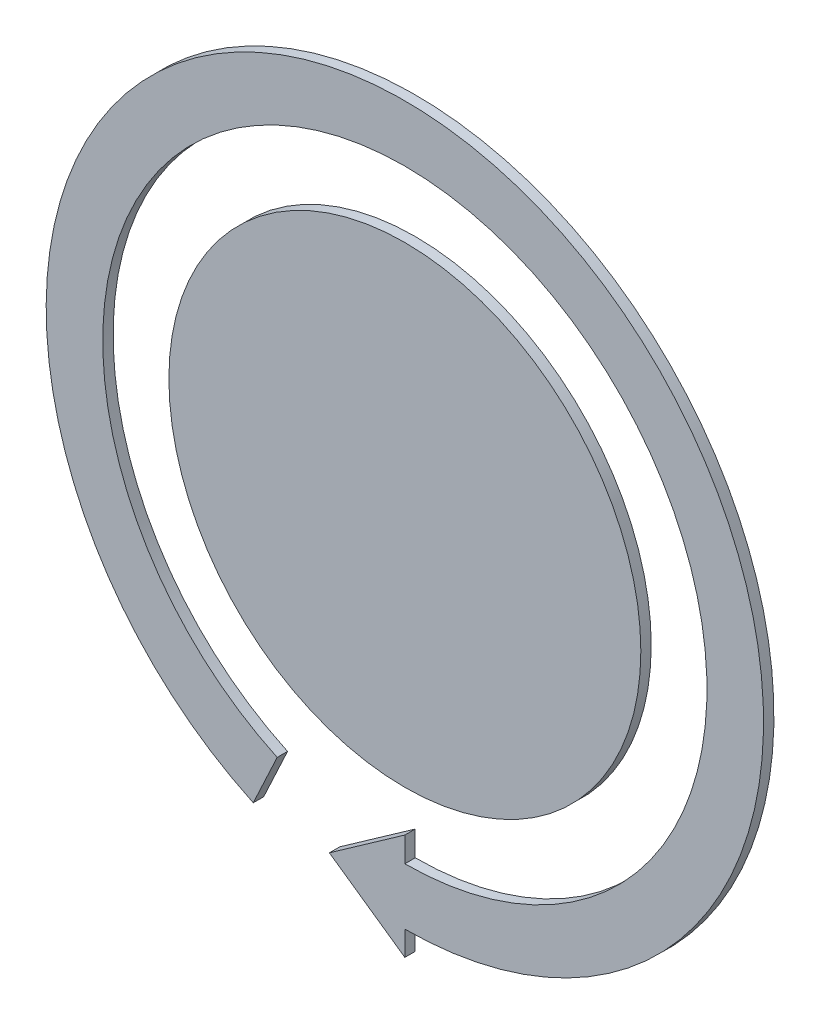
ISO-10303-21;
HEADER;
FILE_DESCRIPTION(('STEP AP214'),'2;1');
FILE_NAME('part.step','',(''),(''),'','','');
FILE_SCHEMA(('AUTOMOTIVE_DESIGN { 1 0 10303 214 1 1 1 1 }'));
ENDSEC;
DATA;
#1=APPLICATION_CONTEXT('core data for automotive mechanical design processes');
#2=APPLICATION_PROTOCOL_DEFINITION('international standard','automotive_design',2000,#1);
#3=PRODUCT_CONTEXT('',#1,'mechanical');
#4=PRODUCT('Part','Part','',(#3));
#5=PRODUCT_RELATED_PRODUCT_CATEGORY('part','',(#4));
#6=PRODUCT_DEFINITION_FORMATION('','',#4);
#7=PRODUCT_DEFINITION_CONTEXT('part definition',#1,'design');
#8=PRODUCT_DEFINITION('design','',#6,#7);
#9=PRODUCT_DEFINITION_SHAPE('','',#8);
#10=(LENGTH_UNIT() NAMED_UNIT(*) SI_UNIT(.MILLI.,.METRE.));
#11=(NAMED_UNIT(*) PLANE_ANGLE_UNIT() SI_UNIT($,.RADIAN.));
#12=(NAMED_UNIT(*) SI_UNIT($,.STERADIAN.) SOLID_ANGLE_UNIT());
#13=UNCERTAINTY_MEASURE_WITH_UNIT(LENGTH_MEASURE(1.E-05),#10,'distance_accuracy_value','');
#14=(GEOMETRIC_REPRESENTATION_CONTEXT(3) GLOBAL_UNCERTAINTY_ASSIGNED_CONTEXT((#13)) GLOBAL_UNIT_ASSIGNED_CONTEXT((#10,
#11,#12)) REPRESENTATION_CONTEXT('',''));
#15=CARTESIAN_POINT('',(0.,0.,0.));
#16=DIRECTION('',(0.,0.,1.));
#17=DIRECTION('',(1.,0.,0.));
#18=AXIS2_PLACEMENT_3D('',#15,#16,#17);
#19=CARTESIAN_POINT('',(0.,0.,2.5));
#20=DIRECTION('',(0.,0.,-1.));
#21=DIRECTION('',(-1.,0.,0.));
#22=AXIS2_PLACEMENT_3D('',#19,#20,#21);
#23=CYLINDRICAL_SURFACE('',#22,72.75);
#24=CARTESIAN_POINT('',(0.,0.,0.));
#25=DIRECTION('',(0.,0.,-1.));
#26=DIRECTION('',(1.,0.,0.));
#27=AXIS2_PLACEMENT_3D('',#24,#25,#26);
#28=CIRCLE('',#27,72.75);
#29=CARTESIAN_POINT('',(-30.7454785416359,-65.9338915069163,0.));
#30=VERTEX_POINT('',#29);
#31=CARTESIAN_POINT('',(0.,-72.75,0.));
#32=VERTEX_POINT('',#31);
#33=EDGE_CURVE('E133',#30,#32,#28,.T.);
#34=ORIENTED_EDGE('',*,*,#33,.T.);
#35=DIRECTION('',(0.,0.,-1.));
#36=VECTOR('',#35,1.);
#37=CARTESIAN_POINT('',(0.,-72.75,2.5));
#38=LINE('',#37,#36);
#39=CARTESIAN_POINT('',(0.,-72.75,2.5));
#40=VERTEX_POINT('',#39);
#41=EDGE_CURVE('E12',#40,#32,#38,.T.);
#42=ORIENTED_EDGE('',*,*,#41,.F.);
#43=CARTESIAN_POINT('',(0.,0.,2.5));
#44=DIRECTION('',(0.,0.,-1.));
#45=DIRECTION('',(1.,0.,0.));
#46=AXIS2_PLACEMENT_3D('',#43,#44,#45);
#47=CIRCLE('',#46,72.75);
#48=CARTESIAN_POINT('',(-30.7454785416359,-65.9338915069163,2.5));
#49=VERTEX_POINT('',#48);
#50=EDGE_CURVE('E145',#49,#40,#47,.T.);
#51=ORIENTED_EDGE('',*,*,#50,.F.);
#52=DIRECTION('',(0.,0.,-1.));
#53=VECTOR('',#52,1.);
#54=CARTESIAN_POINT('',(-30.7454785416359,-65.9338915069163,2.5));
#55=LINE('',#54,#53);
#56=EDGE_CURVE('E129',#49,#30,#55,.T.);
#57=ORIENTED_EDGE('',*,*,#56,.T.);
#58=EDGE_LOOP('',(#34,#42,#51,#57));
#59=FACE_BOUND('',#58,.T.);
#60=ADVANCED_FACE('F43',(#59),#23,.F.);
#61=CARTESIAN_POINT('',(0.,-66.75,2.5));
#62=DIRECTION('',(-1.,0.,0.));
#63=DIRECTION('',(0.,0.,1.));
#64=AXIS2_PLACEMENT_3D('',#61,#62,#63);
#65=PLANE('',#64);
#66=DIRECTION('',(0.,1.,0.));
#67=VECTOR('',#66,1.);
#68=CARTESIAN_POINT('',(0.,-66.75,0.));
#69=LINE('',#68,#67);
#70=CARTESIAN_POINT('',(0.,-66.75,0.));
#71=VERTEX_POINT('',#70);
#72=EDGE_CURVE('E136',#32,#71,#69,.T.);
#73=ORIENTED_EDGE('',*,*,#72,.T.);
#74=DIRECTION('',(0.,0.,-1.));
#75=VECTOR('',#74,1.);
#76=CARTESIAN_POINT('',(0.,-66.75,2.5));
#77=LINE('',#76,#75);
#78=CARTESIAN_POINT('',(0.,-66.75,2.5));
#79=VERTEX_POINT('',#78);
#80=EDGE_CURVE('E51',#79,#71,#77,.T.);
#81=ORIENTED_EDGE('',*,*,#80,.F.);
#82=DIRECTION('',(0.,1.,0.));
#83=VECTOR('',#82,1.);
#84=CARTESIAN_POINT('',(0.,-66.75,2.5));
#85=LINE('',#84,#83);
#86=EDGE_CURVE('E99',#40,#79,#85,.T.);
#87=ORIENTED_EDGE('',*,*,#86,.F.);
#88=ORIENTED_EDGE('',*,*,#41,.T.);
#89=EDGE_LOOP('',(#73,#81,#87,#88));
#90=FACE_BOUND('',#89,.T.);
#91=ADVANCED_FACE('F170',(#90),#65,.F.);
#92=CARTESIAN_POINT('',(-18.1774228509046,-79.5496153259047,2.5));
#93=DIRECTION('',(0.575736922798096,-0.81763500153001,0.));
#94=DIRECTION('',(0.81763500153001,0.575736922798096,0.));
#95=AXIS2_PLACEMENT_3D('',#92,#93,#94);
#96=PLANE('',#95);
#97=DIRECTION('',(-0.81763500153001,-0.575736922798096,0.));
#98=VECTOR('',#97,1.);
#99=CARTESIAN_POINT('',(-18.1774228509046,-79.5496153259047,0.));
#100=LINE('',#99,#98);
#101=CARTESIAN_POINT('',(-18.1774228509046,-79.5496153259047,0.));
#102=VERTEX_POINT('',#101);
#103=EDGE_CURVE('E138',#71,#102,#100,.T.);
#104=ORIENTED_EDGE('',*,*,#103,.T.);
#105=DIRECTION('',(0.,0.,-1.));
#106=VECTOR('',#105,1.);
#107=CARTESIAN_POINT('',(-18.1774228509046,-79.5496153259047,2.5));
#108=LINE('',#107,#106);
#109=CARTESIAN_POINT('',(-18.1774228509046,-79.5496153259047,2.5));
#110=VERTEX_POINT('',#109);
#111=EDGE_CURVE('E149',#110,#102,#108,.T.);
#112=ORIENTED_EDGE('',*,*,#111,.F.);
#113=DIRECTION('',(-0.81763500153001,-0.575736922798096,0.));
#114=VECTOR('',#113,1.);
#115=CARTESIAN_POINT('',(-18.1774228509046,-79.5496153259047,2.5));
#116=LINE('',#115,#114);
#117=EDGE_CURVE('E157',#79,#110,#116,.T.);
#118=ORIENTED_EDGE('',*,*,#117,.F.);
#119=ORIENTED_EDGE('',*,*,#80,.T.);
#120=EDGE_LOOP('',(#104,#112,#118,#119));
#121=FACE_BOUND('',#120,.T.);
#122=ADVANCED_FACE('F155',(#121),#96,.F.);
#123=CARTESIAN_POINT('',(0.,-92.275,2.5));
#124=DIRECTION('',(0.573498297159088,0.819206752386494,0.));
#125=DIRECTION('',(-0.819206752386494,0.573498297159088,0.));
#126=AXIS2_PLACEMENT_3D('',#123,#124,#125);
#127=PLANE('',#126);
#128=DIRECTION('',(0.819206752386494,-0.573498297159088,0.));
#129=VECTOR('',#128,1.);
#130=CARTESIAN_POINT('',(0.,-92.275,0.));
#131=LINE('',#130,#129);
#132=CARTESIAN_POINT('',(0.,-92.275,0.));
#133=VERTEX_POINT('',#132);
#134=EDGE_CURVE('E140',#102,#133,#131,.T.);
#135=ORIENTED_EDGE('',*,*,#134,.T.);
#136=DIRECTION('',(0.,0.,-1.));
#137=VECTOR('',#136,1.);
#138=CARTESIAN_POINT('',(0.,-92.275,2.5));
#139=LINE('',#138,#137);
#140=CARTESIAN_POINT('',(0.,-92.275,2.5));
#141=VERTEX_POINT('',#140);
#142=EDGE_CURVE('E124',#141,#133,#139,.T.);
#143=ORIENTED_EDGE('',*,*,#142,.F.);
#144=DIRECTION('',(0.819206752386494,-0.573498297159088,0.));
#145=VECTOR('',#144,1.);
#146=CARTESIAN_POINT('',(0.,-92.275,2.5));
#147=LINE('',#146,#145);
#148=EDGE_CURVE('E115',#110,#141,#147,.T.);
#149=ORIENTED_EDGE('',*,*,#148,.F.);
#150=ORIENTED_EDGE('',*,*,#111,.T.);
#151=EDGE_LOOP('',(#135,#143,#149,#150));
#152=FACE_BOUND('',#151,.T.);
#153=ADVANCED_FACE('F163',(#152),#127,.F.);
#154=CARTESIAN_POINT('',(0.,-86.375,2.5));
#155=DIRECTION('',(-1.,0.,0.));
#156=DIRECTION('',(0.,0.,1.));
#157=AXIS2_PLACEMENT_3D('',#154,#155,#156);
#158=PLANE('',#157);
#159=DIRECTION('',(0.,1.,0.));
#160=VECTOR('',#159,1.);
#161=CARTESIAN_POINT('',(0.,-86.375,0.));
#162=LINE('',#161,#160);
#163=CARTESIAN_POINT('',(0.,-86.375,0.));
#164=VERTEX_POINT('',#163);
#165=EDGE_CURVE('E123',#133,#164,#162,.T.);
#166=ORIENTED_EDGE('',*,*,#165,.T.);
#167=DIRECTION('',(0.,0.,-1.));
#168=VECTOR('',#167,1.);
#169=CARTESIAN_POINT('',(0.,-86.375,2.5));
#170=LINE('',#169,#168);
#171=CARTESIAN_POINT('',(0.,-86.375,2.5));
#172=VERTEX_POINT('',#171);
#173=EDGE_CURVE('E120',#172,#164,#170,.T.);
#174=ORIENTED_EDGE('',*,*,#173,.F.);
#175=DIRECTION('',(0.,1.,0.));
#176=VECTOR('',#175,1.);
#177=CARTESIAN_POINT('',(0.,-86.375,2.5));
#178=LINE('',#177,#176);
#179=EDGE_CURVE('E109',#141,#172,#178,.T.);
#180=ORIENTED_EDGE('',*,*,#179,.F.);
#181=ORIENTED_EDGE('',*,*,#142,.T.);
#182=EDGE_LOOP('',(#166,#174,#180,#181));
#183=FACE_BOUND('',#182,.T.);
#184=ADVANCED_FACE('F121',(#183),#158,.F.);
#185=CARTESIAN_POINT('',(0.,0.,2.5));
#186=DIRECTION('',(0.,0.,-1.));
#187=DIRECTION('',(-1.,0.,0.));
#188=AXIS2_PLACEMENT_3D('',#185,#186,#187);
#189=CYLINDRICAL_SURFACE('',#188,86.375);
#190=CARTESIAN_POINT('',(0.,0.,0.));
#191=DIRECTION('',(0.,0.,1.));
#192=DIRECTION('',(1.,0.,0.));
#193=AXIS2_PLACEMENT_3D('',#190,#191,#192);
#194=CIRCLE('',#193,86.375);
#195=CARTESIAN_POINT('',(-36.503652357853,-78.2823351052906,0.));
#196=VERTEX_POINT('',#195);
#197=EDGE_CURVE('E85',#164,#196,#194,.T.);
#198=ORIENTED_EDGE('',*,*,#197,.T.);
#199=DIRECTION('',(0.,0.,-1.));
#200=VECTOR('',#199,1.);
#201=CARTESIAN_POINT('',(-36.503652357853,-78.2823351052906,2.5));
#202=LINE('',#201,#200);
#203=CARTESIAN_POINT('',(-36.503652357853,-78.2823351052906,2.5));
#204=VERTEX_POINT('',#203);
#205=EDGE_CURVE('E125',#204,#196,#202,.T.);
#206=ORIENTED_EDGE('',*,*,#205,.F.);
#207=CARTESIAN_POINT('',(0.,0.,2.5));
#208=DIRECTION('',(0.,0.,1.));
#209=DIRECTION('',(1.,0.,0.));
#210=AXIS2_PLACEMENT_3D('',#207,#208,#209);
#211=CIRCLE('',#210,86.375);
#212=EDGE_CURVE('E113',#172,#204,#211,.T.);
#213=ORIENTED_EDGE('',*,*,#212,.F.);
#214=ORIENTED_EDGE('',*,*,#173,.T.);
#215=EDGE_LOOP('',(#198,#206,#213,#214));
#216=FACE_BOUND('',#215,.T.);
#217=ADVANCED_FACE('F127',(#216),#189,.T.);
#218=CARTESIAN_POINT('',(-30.7454785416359,-65.9338915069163,2.5));
#219=DIRECTION('',(-0.90630778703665,0.4226182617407,0.));
#220=DIRECTION('',(-0.4226182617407,-0.90630778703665,0.));
#221=AXIS2_PLACEMENT_3D('',#218,#219,#220);
#222=PLANE('',#221);
#223=DIRECTION('',(0.4226182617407,0.90630778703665,0.));
#224=VECTOR('',#223,1.);
#225=CARTESIAN_POINT('',(-30.7454785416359,-65.9338915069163,0.));
#226=LINE('',#225,#224);
#227=EDGE_CURVE('E91',#196,#30,#226,.T.);
#228=ORIENTED_EDGE('',*,*,#227,.T.);
#229=ORIENTED_EDGE('',*,*,#56,.F.);
#230=DIRECTION('',(0.4226182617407,0.90630778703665,0.));
#231=VECTOR('',#230,1.);
#232=CARTESIAN_POINT('',(-30.7454785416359,-65.9338915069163,2.5));
#233=LINE('',#232,#231);
#234=EDGE_CURVE('E59',#204,#49,#233,.T.);
#235=ORIENTED_EDGE('',*,*,#234,.F.);
#236=ORIENTED_EDGE('',*,*,#205,.T.);
#237=EDGE_LOOP('',(#228,#229,#235,#236));
#238=FACE_BOUND('',#237,.T.);
#239=ADVANCED_FACE('F184',(#238),#222,.F.);
#240=CARTESIAN_POINT('',(0.,0.,2.5));
#241=DIRECTION('',(0.,0.,1.));
#242=DIRECTION('',(1.,0.,0.));
#243=AXIS2_PLACEMENT_3D('',#240,#241,#242);
#244=PLANE('',#243);
#245=ORIENTED_EDGE('',*,*,#50,.T.);
#246=ORIENTED_EDGE('',*,*,#86,.T.);
#247=ORIENTED_EDGE('',*,*,#117,.T.);
#248=ORIENTED_EDGE('',*,*,#148,.T.);
#249=ORIENTED_EDGE('',*,*,#179,.T.);
#250=ORIENTED_EDGE('',*,*,#212,.T.);
#251=ORIENTED_EDGE('',*,*,#234,.T.);
#252=EDGE_LOOP('',(#245,#246,#247,#248,#249,#250,#251));
#253=FACE_BOUND('',#252,.T.);
#254=ADVANCED_FACE('F111',(#253),#244,.T.);
#255=CARTESIAN_POINT('',(0.,0.,0.));
#256=DIRECTION('',(0.,0.,1.));
#257=DIRECTION('',(1.,0.,0.));
#258=AXIS2_PLACEMENT_3D('',#255,#256,#257);
#259=PLANE('',#258);
#260=ORIENTED_EDGE('',*,*,#33,.F.);
#261=ORIENTED_EDGE('',*,*,#227,.F.);
#262=ORIENTED_EDGE('',*,*,#197,.F.);
#263=ORIENTED_EDGE('',*,*,#165,.F.);
#264=ORIENTED_EDGE('',*,*,#134,.F.);
#265=ORIENTED_EDGE('',*,*,#103,.F.);
#266=ORIENTED_EDGE('',*,*,#72,.F.);
#267=EDGE_LOOP('',(#260,#261,#262,#263,#264,#265,#266));
#268=FACE_BOUND('',#267,.T.);
#269=ADVANCED_FACE('F161',(#268),#259,.F.);
#270=CLOSED_SHELL('',(#60,#91,#122,#153,#184,#217,#239,#254,#269));
#271=MANIFOLD_SOLID_BREP('B2',#270);
#272=CARTESIAN_POINT('',(0.,0.,2.5));
#273=DIRECTION('',(0.,0.,-1.));
#274=DIRECTION('',(-1.,0.,0.));
#275=AXIS2_PLACEMENT_3D('',#272,#273,#274);
#276=CYLINDRICAL_SURFACE('',#275,56.825);
#277=CARTESIAN_POINT('',(0.,0.,2.5));
#278=DIRECTION('',(0.,0.,1.));
#279=DIRECTION('',(1.,0.,0.));
#280=AXIS2_PLACEMENT_3D('',#277,#278,#279);
#281=CIRCLE('',#280,56.825);
#282=CARTESIAN_POINT('',(56.825,0.,2.5));
#283=VERTEX_POINT('',#282);
#284=EDGE_CURVE('E42',#283,#283,#281,.T.);
#285=ORIENTED_EDGE('',*,*,#284,.F.);
#286=EDGE_LOOP('',(#285));
#287=FACE_BOUND('',#286,.T.);
#288=CARTESIAN_POINT('',(0.,0.,0.));
#289=DIRECTION('',(0.,0.,1.));
#290=DIRECTION('',(1.,0.,0.));
#291=AXIS2_PLACEMENT_3D('',#288,#289,#290);
#292=CIRCLE('',#291,56.825);
#293=CARTESIAN_POINT('',(56.825,0.,0.));
#294=VERTEX_POINT('',#293);
#295=EDGE_CURVE('E248',#294,#294,#292,.T.);
#296=ORIENTED_EDGE('',*,*,#295,.T.);
#297=EDGE_LOOP('',(#296));
#298=FACE_BOUND('',#297,.T.);
#299=ADVANCED_FACE('F245',(#287,#298),#276,.T.);
#300=CARTESIAN_POINT('',(0.,0.,2.5));
#301=DIRECTION('',(0.,0.,1.));
#302=DIRECTION('',(1.,0.,0.));
#303=AXIS2_PLACEMENT_3D('',#300,#301,#302);
#304=PLANE('',#303);
#305=ORIENTED_EDGE('',*,*,#284,.T.);
#306=EDGE_LOOP('',(#305));
#307=FACE_BOUND('',#306,.T.);
#308=ADVANCED_FACE('F260',(#307),#304,.T.);
#309=CARTESIAN_POINT('',(0.,0.,0.));
#310=DIRECTION('',(0.,0.,1.));
#311=DIRECTION('',(1.,0.,0.));
#312=AXIS2_PLACEMENT_3D('',#309,#310,#311);
#313=PLANE('',#312);
#314=ORIENTED_EDGE('',*,*,#295,.F.);
#315=EDGE_LOOP('',(#314));
#316=FACE_BOUND('',#315,.T.);
#317=ADVANCED_FACE('F258',(#316),#313,.F.);
#318=CLOSED_SHELL('',(#299,#308,#317));
#319=MANIFOLD_SOLID_BREP('B6',#318);
#320=ADVANCED_BREP_SHAPE_REPRESENTATION('',(#18,#271,#319),#14);
#321=SHAPE_DEFINITION_REPRESENTATION(#9,#320);
ENDSEC;
END-ISO-10303-21;
